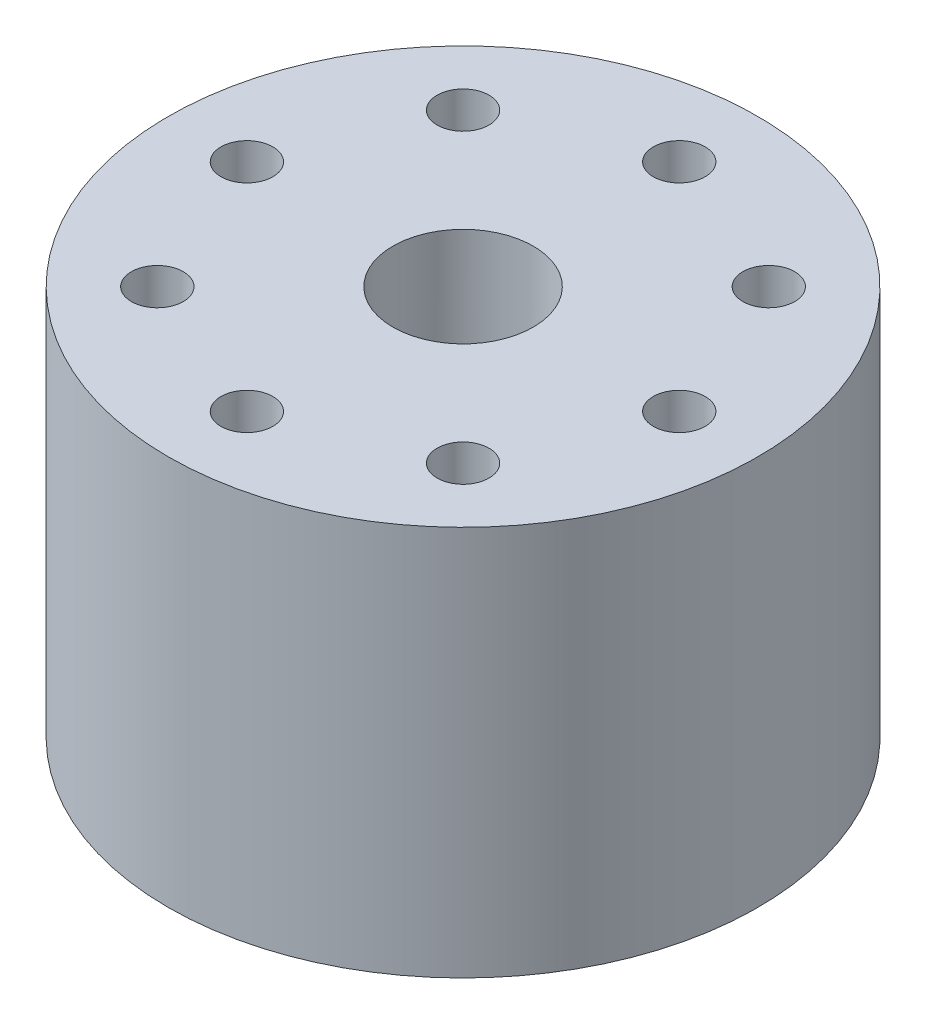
from build123d import *

# Parameters (mm, degrees)
SKETCH1_R                    = 37.5
OUTER_CYLINDER_DEPTH         = 49.65
SKETCH2_R                    = 8.93
NPT_HOLE_DEPTH               = 23
SKETCH3_R                    = 12
OUTER_LEAFLET_DIAMETER_DEPTH = 5
SKETCH4_R                    = 16
DEPTH_DEPTH                  = 3.15
SKETCH8_W                    = 12
SKETCH8_H                    = 6.46
SKETCH9_R                    = 3.3
BOLT_HOLES_DEPTH             = 73.647247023
CHAMFER3_SIZE                = 3
CHAMFER3_SIZE2               = 5.196152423


with BuildPart() as part:
    # Sketch1 → Outer Cylinder (new body)
    with BuildSketch(Plane(origin=(0, 0, 0), x_dir=(1, 0, 0), z_dir=(0, 1, 0))):
        with Locations(Location((0, 0, 0), (0, 0, 270))):
            Circle(SKETCH1_R)
    extrude(amount=OUTER_CYLINDER_DEPTH)

    # Sketch2 → NPT Hole (cut)
    with BuildSketch(Plane(origin=(0, 49.65, 0), x_dir=(1, 0, 0), z_dir=(0, 1, 0))):
        with Locations(Location((0, 0, 0), (0, 0, 270))):
            Circle(SKETCH2_R)
    extrude(amount=-NPT_HOLE_DEPTH, mode=Mode.SUBTRACT)

    # Sketch3 → Outer Leaflet Diameter (cut)
    with BuildSketch(Plane.XZ):
        with Locations(Location((0, 0, 0), (0, 0, 270))):
            Circle(SKETCH3_R)
    extrude(amount=-OUTER_LEAFLET_DIAMETER_DEPTH, mode=Mode.SUBTRACT)

    # Sketch4 → Depth (cut)
    with BuildSketch(Plane.XZ):
        with Locations(Location((0, 0, 0), (0, 0, 270))):
            Circle(SKETCH4_R)
    extrude(amount=-DEPTH_DEPTH, mode=Mode.SUBTRACT)

    # Sketch6 → Aortic Root (revolve, cut)
    with BuildSketch(Plane.XY):
        with BuildLine():
            Line((0, 3.15), (-12, 3.15))
            add(Edge.make_bspline(
                [(-12, 20.19), (-19.2, 11.67), (-12, 3.15)],
                knots=[0, 0, 0, 1, 1, 1], degree=2))
            Line((-12, 20.19), (0, 20.19))
            Line((0, 20.19), (0, 3.15))
        make_face()
    revolve(axis=Axis((0, 3.15, 0), (0, 1, 0)), mode=Mode.SUBTRACT)

    # Sketch8 → Ascending Aorta (revolve, cut)
    with BuildSketch(Plane.XY):
        with Locations((-6, 23.42)):
            Rectangle(SKETCH8_W, SKETCH8_H)
    revolve(axis=Axis((0, 26.65, 0), (0, -1, 0)), mode=Mode.SUBTRACT)

    # Sketch9 → Bolt Holes (cut, through all)
    with BuildSketch(Plane(origin=(0, 49.65, 0), x_dir=(1, 0, 0), z_dir=(0, 1, 0))):
        with Locations(Location((0, -27.5, 0), (0, 0, 270))):
            Circle(SKETCH9_R)
        with Locations(Location((-19.445436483, -19.445436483, 0), (0, 0, 270))):
            Circle(SKETCH9_R)
        with Locations(Location((-27.5, 0, 0), (0, 0, 270))):
            Circle(SKETCH9_R)
        with Locations(Location((-19.445436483, 19.445436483, 0), (0, 0, 270))):
            Circle(SKETCH9_R)
        with Locations(Location((0, 27.5, 0), (0, 0, 270))):
            Circle(SKETCH9_R)
        with Locations(Location((19.445436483, 19.445436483, 0), (0, 0, 270))):
            Circle(SKETCH9_R)
        with Locations(Location((27.5, 0, 0), (0, 0, 270))):
            Circle(SKETCH9_R)
        with Locations(Location((19.445436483, -19.445436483, 0), (0, 0, 270))):
            Circle(SKETCH9_R)
    extrude(amount=-BOLT_HOLES_DEPTH, mode=Mode.SUBTRACT)

    # Chamfer3
    chamfer3_edges = [part.edges().sort_by_distance(p)[0] for p in [
        (0, 26.65, -8.93),
    ]]
    chamfer3_side = [part.faces().sort_by_distance(p)[0] for p in [
        (11.660588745, 26.65, 0),
    ]]
    chamfer(chamfer3_edges, length=CHAMFER3_SIZE, length2=CHAMFER3_SIZE2, reference=chamfer3_side[0])


solid = part.part
